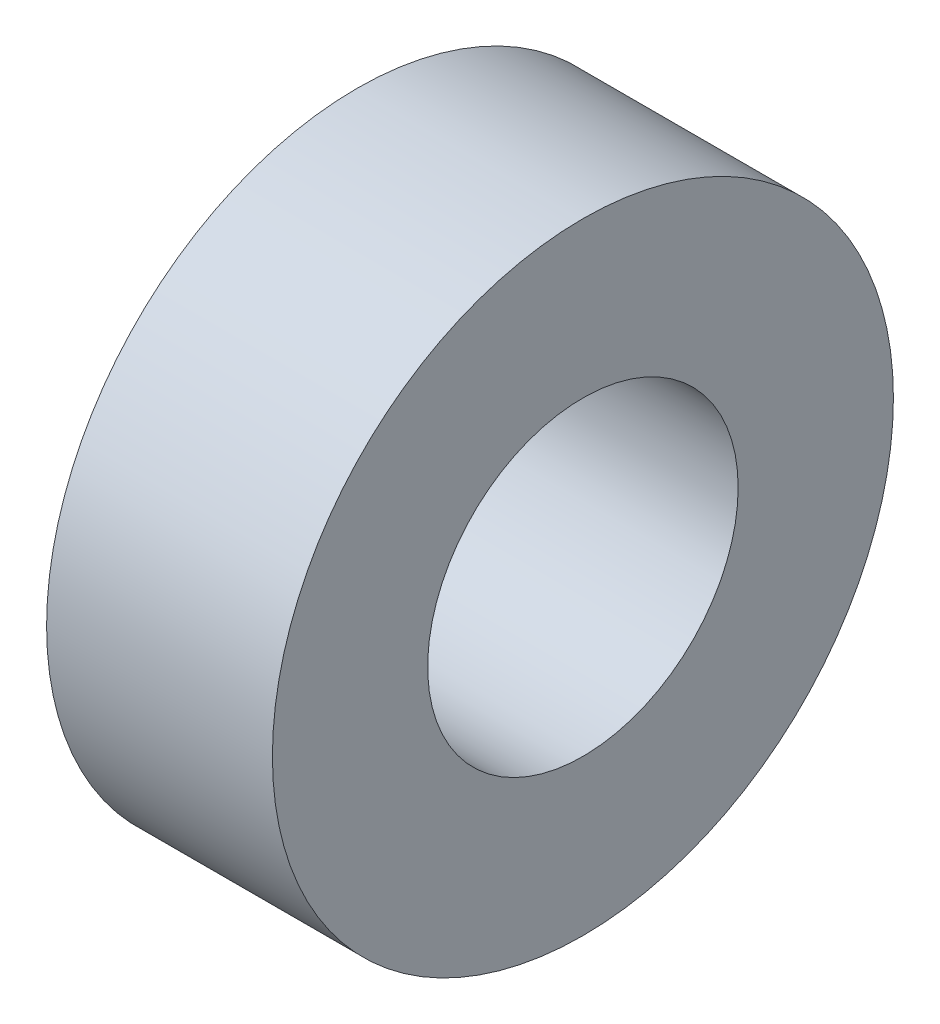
from build123d import *


with BuildPart() as part:
    # Esquisse1 → Base-R_volution (revolve)
    with BuildSketch(Plane.XY, mode=Mode.PRIVATE) as base_r_volution_sk:
        Polygon((-29, 5.5), (-29, 2.75), (-33.5, 2.75), (-33.5, 3.25), (-31, 3.25), (-31, 4.5), (-33, 4.5), (-33, 5.5), align=None)
    revolve(base_r_volution_sk.sketch.rotate(Axis((0, 0, 0), (-1, 0, 0)), 90), axis=Axis((0, 0, 0), (-1, 0, 0)))


solid = part.part
